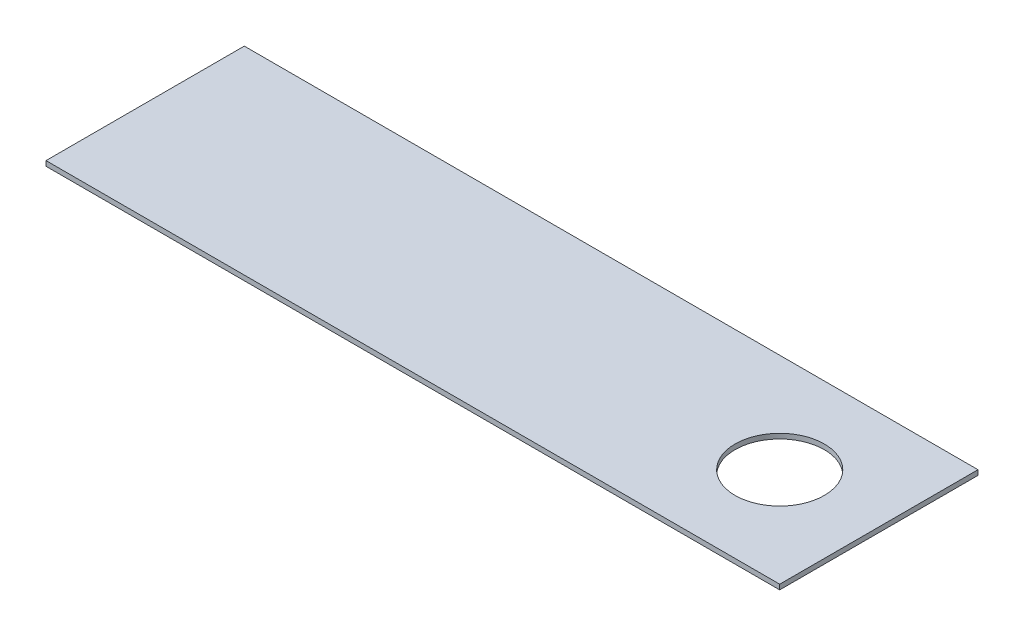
ISO-10303-21;
HEADER;
FILE_DESCRIPTION(('STEP AP214'),'2;1');
FILE_NAME('part.step','',(''),(''),'','','');
FILE_SCHEMA(('AUTOMOTIVE_DESIGN { 1 0 10303 214 1 1 1 1 }'));
ENDSEC;
DATA;
#1=APPLICATION_CONTEXT('core data for automotive mechanical design processes');
#2=APPLICATION_PROTOCOL_DEFINITION('international standard','automotive_design',2000,#1);
#3=PRODUCT_CONTEXT('',#1,'mechanical');
#4=PRODUCT('Part','Part','',(#3));
#5=PRODUCT_RELATED_PRODUCT_CATEGORY('part','',(#4));
#6=PRODUCT_DEFINITION_FORMATION('','',#4);
#7=PRODUCT_DEFINITION_CONTEXT('part definition',#1,'design');
#8=PRODUCT_DEFINITION('design','',#6,#7);
#9=PRODUCT_DEFINITION_SHAPE('','',#8);
#10=(LENGTH_UNIT() NAMED_UNIT(*) SI_UNIT(.MILLI.,.METRE.));
#11=(NAMED_UNIT(*) PLANE_ANGLE_UNIT() SI_UNIT($,.RADIAN.));
#12=(NAMED_UNIT(*) SI_UNIT($,.STERADIAN.) SOLID_ANGLE_UNIT());
#13=UNCERTAINTY_MEASURE_WITH_UNIT(LENGTH_MEASURE(1.E-05),#10,'distance_accuracy_value','');
#14=(GEOMETRIC_REPRESENTATION_CONTEXT(3) GLOBAL_UNCERTAINTY_ASSIGNED_CONTEXT((#13)) GLOBAL_UNIT_ASSIGNED_CONTEXT((#10,
#11,#12)) REPRESENTATION_CONTEXT('',''));
#15=CARTESIAN_POINT('',(0.,0.,0.));
#16=DIRECTION('',(0.,0.,1.));
#17=DIRECTION('',(1.,0.,0.));
#18=AXIS2_PLACEMENT_3D('',#15,#16,#17);
#19=CARTESIAN_POINT('',(0.,0.25,0.));
#20=DIRECTION('',(0.,-1.,0.));
#21=DIRECTION('',(0.,0.,-1.));
#22=AXIS2_PLACEMENT_3D('',#19,#20,#21);
#23=PLANE('',#22);
#24=DIRECTION('',(0.,0.,1.));
#25=VECTOR('',#24,1.);
#26=CARTESIAN_POINT('',(0.,0.25,0.));
#27=LINE('',#26,#25);
#28=CARTESIAN_POINT('',(0.,0.25,-10.));
#29=VERTEX_POINT('',#28);
#30=CARTESIAN_POINT('',(0.,0.25,0.));
#31=VERTEX_POINT('',#30);
#32=EDGE_CURVE('E99',#29,#31,#27,.T.);
#33=ORIENTED_EDGE('',*,*,#32,.T.);
#34=DIRECTION('',(1.,0.,0.));
#35=VECTOR('',#34,1.);
#36=CARTESIAN_POINT('',(0.,0.25,0.));
#37=LINE('',#36,#35);
#38=CARTESIAN_POINT('',(37.,0.25,0.));
#39=VERTEX_POINT('',#38);
#40=EDGE_CURVE('E84',#31,#39,#37,.T.);
#41=ORIENTED_EDGE('',*,*,#40,.T.);
#42=DIRECTION('',(0.,0.,-1.));
#43=VECTOR('',#42,1.);
#44=CARTESIAN_POINT('',(37.,0.25,0.));
#45=LINE('',#44,#43);
#46=CARTESIAN_POINT('',(37.,0.25,-10.));
#47=VERTEX_POINT('',#46);
#48=EDGE_CURVE('E50',#39,#47,#45,.T.);
#49=ORIENTED_EDGE('',*,*,#48,.T.);
#50=DIRECTION('',(-1.,0.,0.));
#51=VECTOR('',#50,1.);
#52=CARTESIAN_POINT('',(0.,0.25,-10.));
#53=LINE('',#52,#51);
#54=EDGE_CURVE('E45',#47,#29,#53,.T.);
#55=ORIENTED_EDGE('',*,*,#54,.T.);
#56=EDGE_LOOP('',(#33,#41,#49,#55));
#57=FACE_BOUND('',#56,.T.);
#58=CARTESIAN_POINT('',(32.,0.25,-5.));
#59=DIRECTION('',(0.,1.,0.));
#60=DIRECTION('',(0.,0.,1.));
#61=AXIS2_PLACEMENT_3D('',#58,#59,#60);
#62=CIRCLE('',#61,2.25);
#63=CARTESIAN_POINT('',(32.,0.25,-2.75));
#64=VERTEX_POINT('',#63);
#65=EDGE_CURVE('E89',#64,#64,#62,.T.);
#66=ORIENTED_EDGE('',*,*,#65,.F.);
#67=EDGE_LOOP('',(#66));
#68=FACE_BOUND('',#67,.T.);
#69=ADVANCED_FACE('F30',(#57,#68),#23,.F.);
#70=CARTESIAN_POINT('',(0.,0.,0.));
#71=DIRECTION('',(0.,-1.,0.));
#72=DIRECTION('',(0.,0.,-1.));
#73=AXIS2_PLACEMENT_3D('',#70,#71,#72);
#74=PLANE('',#73);
#75=DIRECTION('',(0.,0.,1.));
#76=VECTOR('',#75,1.);
#77=CARTESIAN_POINT('',(0.,0.,0.));
#78=LINE('',#77,#76);
#79=CARTESIAN_POINT('',(0.,0.,-10.));
#80=VERTEX_POINT('',#79);
#81=CARTESIAN_POINT('',(0.,0.,0.));
#82=VERTEX_POINT('',#81);
#83=EDGE_CURVE('E76',#80,#82,#78,.T.);
#84=ORIENTED_EDGE('',*,*,#83,.F.);
#85=DIRECTION('',(-1.,0.,0.));
#86=VECTOR('',#85,1.);
#87=CARTESIAN_POINT('',(0.,0.,-10.));
#88=LINE('',#87,#86);
#89=CARTESIAN_POINT('',(37.,0.,-10.));
#90=VERTEX_POINT('',#89);
#91=EDGE_CURVE('E97',#90,#80,#88,.T.);
#92=ORIENTED_EDGE('',*,*,#91,.F.);
#93=DIRECTION('',(0.,0.,-1.));
#94=VECTOR('',#93,1.);
#95=CARTESIAN_POINT('',(37.,0.,0.));
#96=LINE('',#95,#94);
#97=CARTESIAN_POINT('',(37.,0.,0.));
#98=VERTEX_POINT('',#97);
#99=EDGE_CURVE('E77',#98,#90,#96,.T.);
#100=ORIENTED_EDGE('',*,*,#99,.F.);
#101=DIRECTION('',(1.,0.,0.));
#102=VECTOR('',#101,1.);
#103=CARTESIAN_POINT('',(0.,0.,0.));
#104=LINE('',#103,#102);
#105=EDGE_CURVE('E71',#82,#98,#104,.T.);
#106=ORIENTED_EDGE('',*,*,#105,.F.);
#107=EDGE_LOOP('',(#84,#92,#100,#106));
#108=FACE_BOUND('',#107,.T.);
#109=CARTESIAN_POINT('',(32.,0.,-5.));
#110=DIRECTION('',(0.,1.,0.));
#111=DIRECTION('',(0.,0.,1.));
#112=AXIS2_PLACEMENT_3D('',#109,#110,#111);
#113=CIRCLE('',#112,2.25);
#114=CARTESIAN_POINT('',(32.,0.,-2.75));
#115=VERTEX_POINT('',#114);
#116=EDGE_CURVE('E92',#115,#115,#113,.T.);
#117=ORIENTED_EDGE('',*,*,#116,.T.);
#118=EDGE_LOOP('',(#117));
#119=FACE_BOUND('',#118,.T.);
#120=ADVANCED_FACE('F72',(#108,#119),#74,.T.);
#121=CARTESIAN_POINT('',(0.,0.25,0.));
#122=DIRECTION('',(1.,0.,0.));
#123=DIRECTION('',(0.,0.,-1.));
#124=AXIS2_PLACEMENT_3D('',#121,#122,#123);
#125=PLANE('',#124);
#126=ORIENTED_EDGE('',*,*,#83,.T.);
#127=DIRECTION('',(0.,-1.,0.));
#128=VECTOR('',#127,1.);
#129=CARTESIAN_POINT('',(0.,0.25,0.));
#130=LINE('',#129,#128);
#131=EDGE_CURVE('E11',#31,#82,#130,.T.);
#132=ORIENTED_EDGE('',*,*,#131,.F.);
#133=ORIENTED_EDGE('',*,*,#32,.F.);
#134=DIRECTION('',(0.,-1.,0.));
#135=VECTOR('',#134,1.);
#136=CARTESIAN_POINT('',(0.,0.25,-10.));
#137=LINE('',#136,#135);
#138=EDGE_CURVE('E88',#29,#80,#137,.T.);
#139=ORIENTED_EDGE('',*,*,#138,.T.);
#140=EDGE_LOOP('',(#126,#132,#133,#139));
#141=FACE_BOUND('',#140,.T.);
#142=ADVANCED_FACE('F32',(#141),#125,.F.);
#143=CARTESIAN_POINT('',(0.,0.25,0.));
#144=DIRECTION('',(0.,0.,-1.));
#145=DIRECTION('',(-1.,0.,0.));
#146=AXIS2_PLACEMENT_3D('',#143,#144,#145);
#147=PLANE('',#146);
#148=ORIENTED_EDGE('',*,*,#105,.T.);
#149=DIRECTION('',(0.,-1.,0.));
#150=VECTOR('',#149,1.);
#151=CARTESIAN_POINT('',(37.,0.25,0.));
#152=LINE('',#151,#150);
#153=EDGE_CURVE('E38',#39,#98,#152,.T.);
#154=ORIENTED_EDGE('',*,*,#153,.F.);
#155=ORIENTED_EDGE('',*,*,#40,.F.);
#156=ORIENTED_EDGE('',*,*,#131,.T.);
#157=EDGE_LOOP('',(#148,#154,#155,#156));
#158=FACE_BOUND('',#157,.T.);
#159=ADVANCED_FACE('F83',(#158),#147,.F.);
#160=CARTESIAN_POINT('',(37.,0.25,0.));
#161=DIRECTION('',(-1.,0.,0.));
#162=DIRECTION('',(0.,0.,1.));
#163=AXIS2_PLACEMENT_3D('',#160,#161,#162);
#164=PLANE('',#163);
#165=ORIENTED_EDGE('',*,*,#99,.T.);
#166=DIRECTION('',(0.,-1.,0.));
#167=VECTOR('',#166,1.);
#168=CARTESIAN_POINT('',(37.,0.25,-10.));
#169=LINE('',#168,#167);
#170=EDGE_CURVE('E105',#47,#90,#169,.T.);
#171=ORIENTED_EDGE('',*,*,#170,.F.);
#172=ORIENTED_EDGE('',*,*,#48,.F.);
#173=ORIENTED_EDGE('',*,*,#153,.T.);
#174=EDGE_LOOP('',(#165,#171,#172,#173));
#175=FACE_BOUND('',#174,.T.);
#176=ADVANCED_FACE('F108',(#175),#164,.F.);
#177=CARTESIAN_POINT('',(0.,0.25,-10.));
#178=DIRECTION('',(0.,0.,1.));
#179=DIRECTION('',(1.,0.,0.));
#180=AXIS2_PLACEMENT_3D('',#177,#178,#179);
#181=PLANE('',#180);
#182=ORIENTED_EDGE('',*,*,#91,.T.);
#183=ORIENTED_EDGE('',*,*,#138,.F.);
#184=ORIENTED_EDGE('',*,*,#54,.F.);
#185=ORIENTED_EDGE('',*,*,#170,.T.);
#186=EDGE_LOOP('',(#182,#183,#184,#185));
#187=FACE_BOUND('',#186,.T.);
#188=ADVANCED_FACE('F110',(#187),#181,.F.);
#189=CARTESIAN_POINT('',(32.,0.25,-5.));
#190=DIRECTION('',(0.,-1.,0.));
#191=DIRECTION('',(0.,0.,-1.));
#192=AXIS2_PLACEMENT_3D('',#189,#190,#191);
#193=CYLINDRICAL_SURFACE('',#192,2.25);
#194=ORIENTED_EDGE('',*,*,#65,.T.);
#195=EDGE_LOOP('',(#194));
#196=FACE_BOUND('',#195,.T.);
#197=ORIENTED_EDGE('',*,*,#116,.F.);
#198=EDGE_LOOP('',(#197));
#199=FACE_BOUND('',#198,.T.);
#200=ADVANCED_FACE('F116',(#196,#199),#193,.F.);
#201=CLOSED_SHELL('',(#69,#120,#142,#159,#176,#188,#200));
#202=MANIFOLD_SOLID_BREP('B2',#201);
#203=ADVANCED_BREP_SHAPE_REPRESENTATION('',(#18,#202),#14);
#204=SHAPE_DEFINITION_REPRESENTATION(#9,#203);
ENDSEC;
END-ISO-10303-21;
